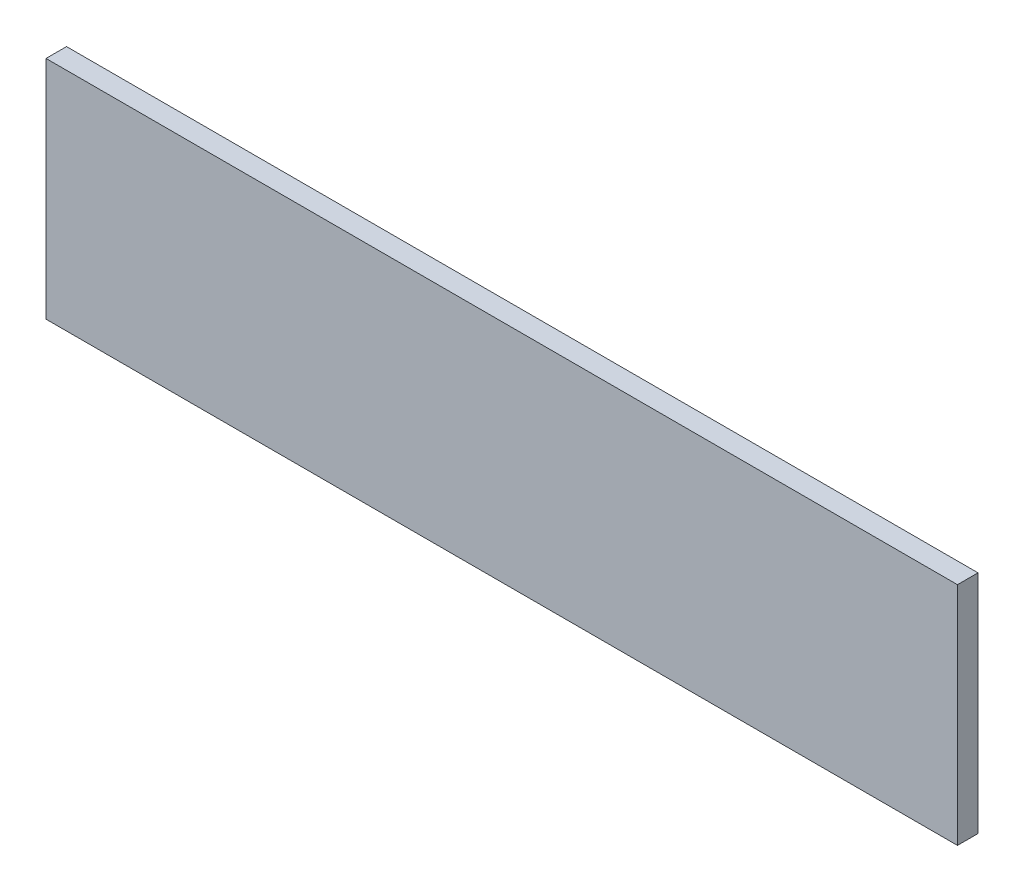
from build123d import *

# Parameters (mm, degrees)
SKIZZE2_W               = 222
SKIZZE2_H               = 55
LINEAR_AUSTRAGEN1_DEPTH = 5


with BuildPart() as part:
    # Skizze2 → Linear austragen1 (new body)
    with BuildSketch(Plane.XY):
        with Locations((-111, 27.5)):
            Rectangle(SKIZZE2_W, SKIZZE2_H)
    extrude(amount=LINEAR_AUSTRAGEN1_DEPTH)


solid = part.part
